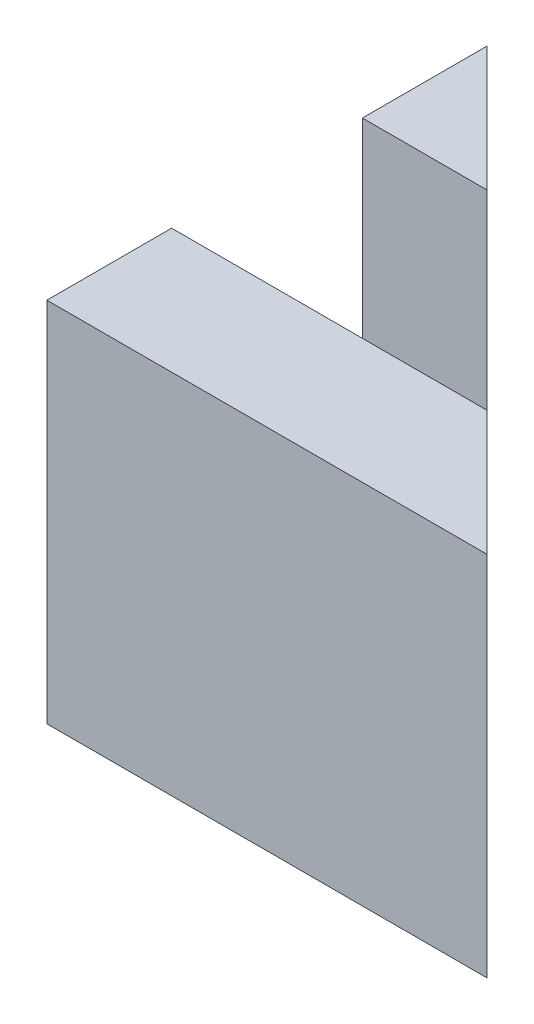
from build123d import *

# Parameters (mm, degrees)
ESQUISSE1_W             = 5.5
ESQUISSE1_H             = 7
ESQUISSE1_H_2           = 6
ESQUISSE1_W_2           = 5.75
EXTRUSION1_DEPTH        = 30
D_POUILLE1_ANGLE        = 1
ENL_V_MAT_EXTRU_1_DEPTH = 50.244289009


with BuildPart() as part:
    # Esquisse1 → Extrusion1 (new body)
    with BuildSketch(Plane(origin=(0, 0, 0), x_dir=(0, 0, -1), z_dir=(1, 0, 0))):
        Polygon((8.5, 9), (8.5, 25), (0, 25), (0, 0), (30, 0), (30, 25), (21.5, 25), (21.5, 9), align=None)
        with Locations((4.25, 12.5)):
            Rectangle(ESQUISSE1_W, ESQUISSE1_H, mode=Mode.SUBTRACT)
        with Locations((4.25, 4.5)):
            Rectangle(ESQUISSE1_W, ESQUISSE1_H_2, mode=Mode.SUBTRACT)
        with Locations((4.25, 20.5)):
            Rectangle(ESQUISSE1_W, ESQUISSE1_H_2, mode=Mode.SUBTRACT)
        with Locations((11.375, 4.5)):
            Rectangle(ESQUISSE1_W_2, ESQUISSE1_H_2, mode=Mode.SUBTRACT)
        with Locations((18.625, 4.5)):
            Rectangle(ESQUISSE1_W_2, ESQUISSE1_H_2, mode=Mode.SUBTRACT)
        with Locations((25.75, 20.5)):
            Rectangle(ESQUISSE1_W, ESQUISSE1_H_2, mode=Mode.SUBTRACT)
        with Locations((25.75, 12.5)):
            Rectangle(ESQUISSE1_W, ESQUISSE1_H, mode=Mode.SUBTRACT)
        with Locations((25.75, 4.5)):
            Rectangle(ESQUISSE1_W, ESQUISSE1_H_2, mode=Mode.SUBTRACT)
    extrude(amount=EXTRUSION1_DEPTH)

    # D_pouille1
    d_pouille1_faces = [part.faces().sort_by_distance(p)[0] for p in [
        (15, 23.5, -25.75),
        (15, 20.5, -23),
        (15, 16, -25.75),
        (15, 12.5, -23),
        (15, 7.5, -25.75),
        (15, 4.5, -23),
        (15, 7.5, -18.625),
        (15, 4.5, -15.75),
        (15, 7.5, -11.375),
        (15, 4.5, -8.5),
        (15, 23.5, -4.25),
        (15, 20.5, -1.5),
        (15, 16, -4.25),
        (15, 12.5, -1.5),
        (15, 7.5, -4.25),
        (15, 4.5, -1.5),
        (15, 20.5, -28.5),
        (15, 17.5, -25.75),
        (15, 12.5, -28.5),
        (15, 9, -25.75),
        (15, 4.5, -28.5),
        (15, 1.5, -25.75),
        (15, 4.5, -21.5),
        (15, 1.5, -18.625),
        (15, 4.5, -14.25),
        (15, 1.5, -11.375),
        (15, 4.5, -7),
        (15, 1.5, -4.25),
        (15, 12.5, -7),
        (15, 9, -4.25),
        (15, 20.5, -7),
        (15, 17.5, -4.25),
    ]]
    draft(d_pouille1_faces, Plane(origin=(30, 9, -21.5), x_dir=(0, 0, 1), z_dir=(1, 0, 0)), D_POUILLE1_ANGLE)

    # Esquisse2 → Enl_v. mat.-Extru.1 (cut, through all)
    with BuildSketch(Plane(origin=(0, 25, 0), x_dir=(-1, 0, 0), z_dir=(0, 1, 0))):
        Polygon((1.377983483, -31.377983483), (-31.158983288, 1.158983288), (-31.158983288, -31.377983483), align=None)
    extrude(amount=-ENL_V_MAT_EXTRU_1_DEPTH, mode=Mode.SUBTRACT)


solid = part.part
